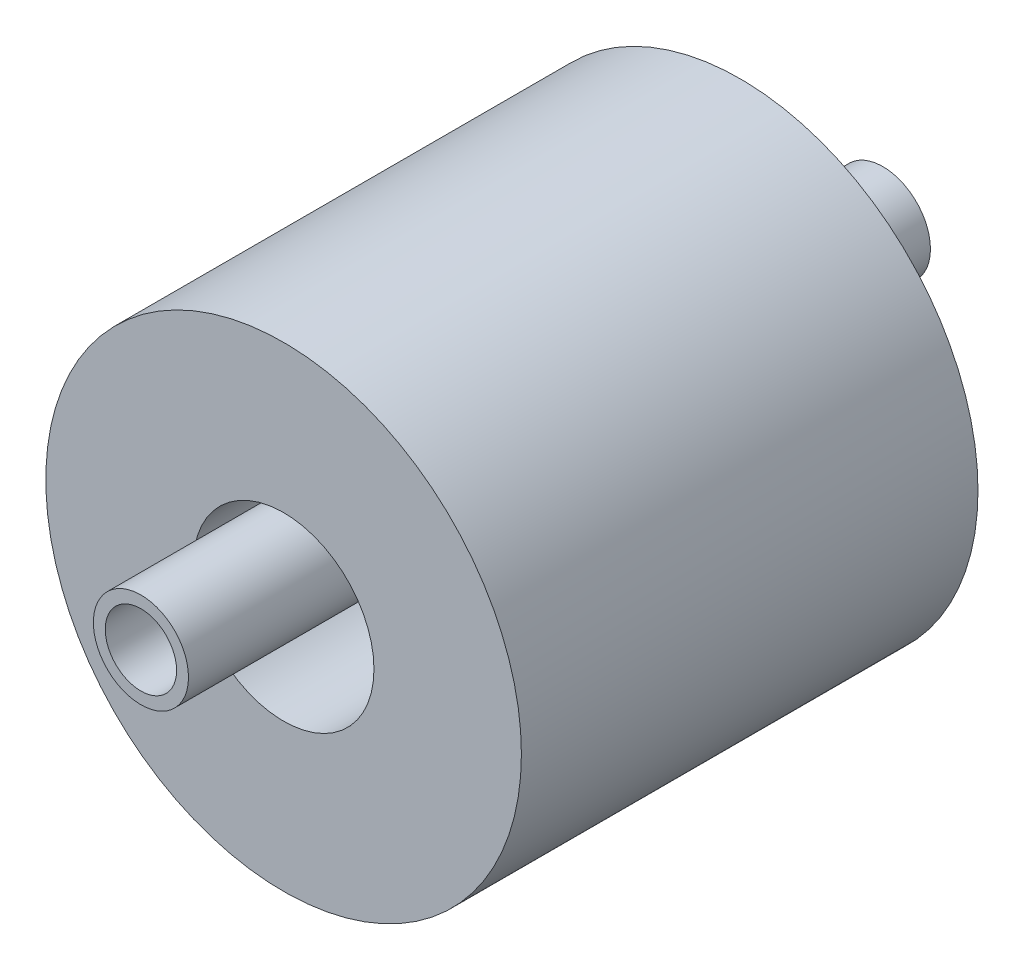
from build123d import *

# Parameters (mm, degrees)
ESQUISSE1_R             = 50
ESQUISSE1_R_2           = 19
BOSS_EXTRU_1_DEPTH      = 96
BOSS_EXTRU_2_DEPTH      = 30
BOSS_EXTRU_2_DEPTH_BACK = 126
ESQUISSE2_R             = 10
ESQUISSE2_R_2           = 7.5


with BuildPart() as part:
    # Esquisse1 → Boss.-Extru.1 (new body)
    with BuildSketch(Plane.XY):
        Circle(ESQUISSE1_R)
        Circle(ESQUISSE1_R_2, mode=Mode.SUBTRACT)
    extrude(amount=BOSS_EXTRU_1_DEPTH)


with BuildPart() as body_2:
    # Esquisse2 → Boss.-Extru.2 (new, two sides: drawn at the far end of the back side and taken through both)
    with BuildSketch(Plane.XY.offset(96).offset(-BOSS_EXTRU_2_DEPTH_BACK)):
        with Locations((0, 9)):
            Circle(ESQUISSE2_R)
        with Locations((0, 9)):
            Circle(ESQUISSE2_R_2, mode=Mode.SUBTRACT)
    extrude(amount=BOSS_EXTRU_2_DEPTH + BOSS_EXTRU_2_DEPTH_BACK)


solid = Compound([part.part, body_2.part])
